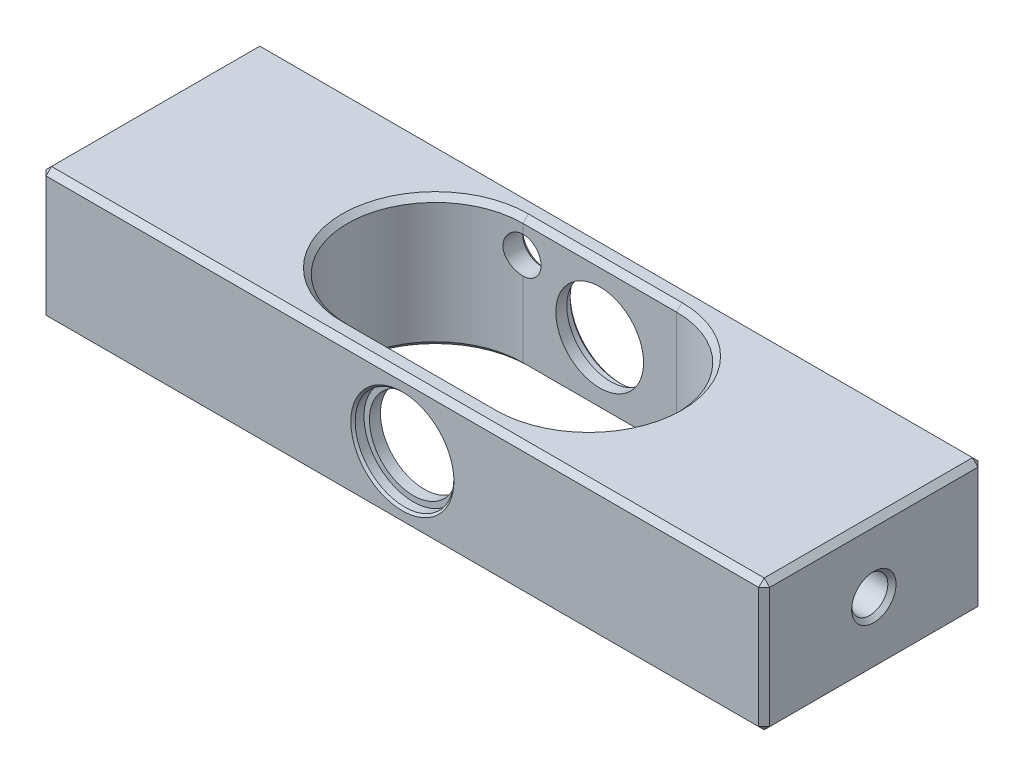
ISO-10303-21;
HEADER;
FILE_DESCRIPTION(('STEP AP214'),'2;1');
FILE_NAME('part.step','',(''),(''),'','','');
FILE_SCHEMA(('AUTOMOTIVE_DESIGN { 1 0 10303 214 1 1 1 1 }'));
ENDSEC;
DATA;
#1=APPLICATION_CONTEXT('core data for automotive mechanical design processes');
#2=APPLICATION_PROTOCOL_DEFINITION('international standard','automotive_design',2000,#1);
#3=PRODUCT_CONTEXT('',#1,'mechanical');
#4=PRODUCT('Part','Part','',(#3));
#5=PRODUCT_RELATED_PRODUCT_CATEGORY('part','',(#4));
#6=PRODUCT_DEFINITION_FORMATION('','',#4);
#7=PRODUCT_DEFINITION_CONTEXT('part definition',#1,'design');
#8=PRODUCT_DEFINITION('design','',#6,#7);
#9=PRODUCT_DEFINITION_SHAPE('','',#8);
#10=(LENGTH_UNIT() NAMED_UNIT(*) SI_UNIT(.MILLI.,.METRE.));
#11=(NAMED_UNIT(*) PLANE_ANGLE_UNIT() SI_UNIT($,.RADIAN.));
#12=(NAMED_UNIT(*) SI_UNIT($,.STERADIAN.) SOLID_ANGLE_UNIT());
#13=UNCERTAINTY_MEASURE_WITH_UNIT(LENGTH_MEASURE(1.E-05),#10,'distance_accuracy_value','');
#14=(GEOMETRIC_REPRESENTATION_CONTEXT(3) GLOBAL_UNCERTAINTY_ASSIGNED_CONTEXT((#13)) GLOBAL_UNIT_ASSIGNED_CONTEXT((#10,
#11,#12)) REPRESENTATION_CONTEXT('',''));
#15=CARTESIAN_POINT('',(0.,0.,0.));
#16=DIRECTION('',(0.,0.,1.));
#17=DIRECTION('',(1.,0.,0.));
#18=AXIS2_PLACEMENT_3D('',#15,#16,#17);
#19=CARTESIAN_POINT('',(33.,6.,0.));
#20=DIRECTION('',(0.,0.,-1.));
#21=DIRECTION('',(-1.,0.,0.));
#22=AXIS2_PLACEMENT_3D('',#19,#20,#21);
#23=CYLINDRICAL_SURFACE('',#22,4.);
#24=CARTESIAN_POINT('',(33.,6.,-18.));
#25=DIRECTION('',(0.,0.,-1.));
#26=DIRECTION('',(-1.,0.,0.));
#27=AXIS2_PLACEMENT_3D('',#24,#25,#26);
#28=CIRCLE('',#27,4.);
#29=CARTESIAN_POINT('',(29.,6.,-18.));
#30=VERTEX_POINT('',#29);
#31=EDGE_CURVE('E388',#30,#30,#28,.T.);
#32=ORIENTED_EDGE('',*,*,#31,.F.);
#33=EDGE_LOOP('',(#32));
#34=FACE_BOUND('',#33,.T.);
#35=CARTESIAN_POINT('',(33.,6.,-19.));
#36=DIRECTION('',(0.,0.,-1.));
#37=DIRECTION('',(-1.,0.,0.));
#38=AXIS2_PLACEMENT_3D('',#35,#36,#37);
#39=CIRCLE('',#38,4.);
#40=CARTESIAN_POINT('',(29.,6.,-19.));
#41=VERTEX_POINT('',#40);
#42=EDGE_CURVE('E395',#41,#41,#39,.F.);
#43=ORIENTED_EDGE('',*,*,#42,.F.);
#44=EDGE_LOOP('',(#43));
#45=FACE_BOUND('',#44,.T.);
#46=ADVANCED_FACE('F38',(#34,#45),#23,.F.);
#47=CARTESIAN_POINT('',(33.,6.,-2.));
#48=DIRECTION('',(0.,0.,1.));
#49=DIRECTION('',(1.,0.,0.));
#50=AXIS2_PLACEMENT_3D('',#47,#48,#49);
#51=CIRCLE('',#50,4.);
#52=CARTESIAN_POINT('',(37.,6.,-2.));
#53=VERTEX_POINT('',#52);
#54=EDGE_CURVE('E381',#53,#53,#51,.T.);
#55=ORIENTED_EDGE('',*,*,#54,.F.);
#56=EDGE_LOOP('',(#55));
#57=FACE_BOUND('',#56,.T.);
#58=CARTESIAN_POINT('',(33.,6.,-1.));
#59=DIRECTION('',(0.,0.,1.));
#60=DIRECTION('',(1.,0.,0.));
#61=AXIS2_PLACEMENT_3D('',#58,#59,#60);
#62=CIRCLE('',#61,4.);
#63=CARTESIAN_POINT('',(37.,6.,-1.));
#64=VERTEX_POINT('',#63);
#65=EDGE_CURVE('E391',#64,#64,#62,.F.);
#66=ORIENTED_EDGE('',*,*,#65,.F.);
#67=EDGE_LOOP('',(#66));
#68=FACE_BOUND('',#67,.T.);
#69=ADVANCED_FACE('F419',(#57,#68),#23,.F.);
#70=CARTESIAN_POINT('',(0.,12.,0.));
#71=DIRECTION('',(1.,0.,0.));
#72=DIRECTION('',(0.,0.,-1.));
#73=AXIS2_PLACEMENT_3D('',#70,#71,#72);
#74=PLANE('',#73);
#75=CARTESIAN_POINT('',(0.,6.,-10.));
#76=DIRECTION('',(-1.,0.,0.));
#77=DIRECTION('',(0.,0.,1.));
#78=AXIS2_PLACEMENT_3D('',#75,#76,#77);
#79=CIRCLE('',#78,2.025);
#80=CARTESIAN_POINT('',(0.,6.,-7.975));
#81=VERTEX_POINT('',#80);
#82=EDGE_CURVE('E1107',#81,#81,#79,.T.);
#83=ORIENTED_EDGE('',*,*,#82,.F.);
#84=EDGE_LOOP('',(#83));
#85=FACE_BOUND('',#84,.T.);
#86=DIRECTION('',(0.,-1.,0.));
#87=VECTOR('',#86,1.);
#88=CARTESIAN_POINT('',(0.,12.,-19.5));
#89=LINE('',#88,#87);
#90=CARTESIAN_POINT('',(0.,11.5,-19.5));
#91=VERTEX_POINT('',#90);
#92=CARTESIAN_POINT('',(0.,0.499999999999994,-19.5));
#93=VERTEX_POINT('',#92);
#94=EDGE_CURVE('E255',#91,#93,#89,.T.);
#95=ORIENTED_EDGE('',*,*,#94,.T.);
#96=DIRECTION('',(0.,0.,1.));
#97=VECTOR('',#96,1.);
#98=CARTESIAN_POINT('',(0.,0.499999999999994,0.));
#99=LINE('',#98,#97);
#100=CARTESIAN_POINT('',(0.,0.499999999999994,-0.499999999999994));
#101=VERTEX_POINT('',#100);
#102=EDGE_CURVE('E257',#93,#101,#99,.T.);
#103=ORIENTED_EDGE('',*,*,#102,.T.);
#104=DIRECTION('',(0.,1.,0.));
#105=VECTOR('',#104,1.);
#106=CARTESIAN_POINT('',(0.,12.,-0.499999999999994));
#107=LINE('',#106,#105);
#108=CARTESIAN_POINT('',(0.,11.5,-0.499999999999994));
#109=VERTEX_POINT('',#108);
#110=EDGE_CURVE('E253',#101,#109,#107,.T.);
#111=ORIENTED_EDGE('',*,*,#110,.T.);
#112=DIRECTION('',(0.,0.,-1.));
#113=VECTOR('',#112,1.);
#114=CARTESIAN_POINT('',(0.,11.5,0.));
#115=LINE('',#114,#113);
#116=EDGE_CURVE('E251',#109,#91,#115,.T.);
#117=ORIENTED_EDGE('',*,*,#116,.T.);
#118=EDGE_LOOP('',(#95,#103,#111,#117));
#119=FACE_BOUND('',#118,.T.);
#120=ADVANCED_FACE('F425',(#85,#119),#74,.F.);
#121=CARTESIAN_POINT('',(0.,12.,0.));
#122=DIRECTION('',(0.,0.,-1.));
#123=DIRECTION('',(-1.,0.,0.));
#124=AXIS2_PLACEMENT_3D('',#121,#122,#123);
#125=PLANE('',#124);
#126=CARTESIAN_POINT('',(33.,6.,0.));
#127=DIRECTION('',(0.,0.,-1.));
#128=DIRECTION('',(-1.,0.,0.));
#129=AXIS2_PLACEMENT_3D('',#126,#127,#128);
#130=CIRCLE('',#129,4.7);
#131=CARTESIAN_POINT('',(28.3,6.,0.));
#132=VERTEX_POINT('',#131);
#133=EDGE_CURVE('E11',#132,#132,#130,.T.);
#134=ORIENTED_EDGE('',*,*,#133,.T.);
#135=EDGE_LOOP('',(#134));
#136=FACE_BOUND('',#135,.T.);
#137=DIRECTION('',(-1.,0.,0.));
#138=VECTOR('',#137,1.);
#139=CARTESIAN_POINT('',(0.,11.5,0.));
#140=LINE('',#139,#138);
#141=CARTESIAN_POINT('',(65.5,11.5,0.));
#142=VERTEX_POINT('',#141);
#143=CARTESIAN_POINT('',(0.5,11.5,0.));
#144=VERTEX_POINT('',#143);
#145=EDGE_CURVE('E278',#142,#144,#140,.T.);
#146=ORIENTED_EDGE('',*,*,#145,.T.);
#147=DIRECTION('',(0.,-1.,0.));
#148=VECTOR('',#147,1.);
#149=CARTESIAN_POINT('',(0.5,12.,0.));
#150=LINE('',#149,#148);
#151=CARTESIAN_POINT('',(0.5,0.5,0.));
#152=VERTEX_POINT('',#151);
#153=EDGE_CURVE('E284',#144,#152,#150,.T.);
#154=ORIENTED_EDGE('',*,*,#153,.T.);
#155=DIRECTION('',(1.,0.,0.));
#156=VECTOR('',#155,1.);
#157=CARTESIAN_POINT('',(66.,0.5,0.));
#158=LINE('',#157,#156);
#159=CARTESIAN_POINT('',(65.5,0.5,0.));
#160=VERTEX_POINT('',#159);
#161=EDGE_CURVE('E282',#152,#160,#158,.T.);
#162=ORIENTED_EDGE('',*,*,#161,.T.);
#163=DIRECTION('',(0.,1.,0.));
#164=VECTOR('',#163,1.);
#165=CARTESIAN_POINT('',(65.5,12.,0.));
#166=LINE('',#165,#164);
#167=EDGE_CURVE('E280',#160,#142,#166,.T.);
#168=ORIENTED_EDGE('',*,*,#167,.T.);
#169=EDGE_LOOP('',(#146,#154,#162,#168));
#170=FACE_BOUND('',#169,.T.);
#171=ADVANCED_FACE('F1016',(#136,#170),#125,.F.);
#172=CARTESIAN_POINT('',(66.,12.,0.));
#173=DIRECTION('',(-1.,0.,0.));
#174=DIRECTION('',(0.,0.,1.));
#175=AXIS2_PLACEMENT_3D('',#172,#173,#174);
#176=PLANE('',#175);
#177=CARTESIAN_POINT('',(66.,6.,-10.));
#178=DIRECTION('',(1.,0.,0.));
#179=DIRECTION('',(0.,0.,-1.));
#180=AXIS2_PLACEMENT_3D('',#177,#178,#179);
#181=CIRCLE('',#180,2.025);
#182=CARTESIAN_POINT('',(66.,6.,-12.025));
#183=VERTEX_POINT('',#182);
#184=EDGE_CURVE('E200',#183,#183,#181,.T.);
#185=ORIENTED_EDGE('',*,*,#184,.F.);
#186=EDGE_LOOP('',(#185));
#187=FACE_BOUND('',#186,.T.);
#188=DIRECTION('',(0.,0.,-1.));
#189=VECTOR('',#188,1.);
#190=CARTESIAN_POINT('',(66.,0.5,-20.));
#191=LINE('',#190,#189);
#192=CARTESIAN_POINT('',(66.,0.5,-0.5));
#193=VERTEX_POINT('',#192);
#194=CARTESIAN_POINT('',(66.,0.5,-19.5));
#195=VERTEX_POINT('',#194);
#196=EDGE_CURVE('E273',#193,#195,#191,.T.);
#197=ORIENTED_EDGE('',*,*,#196,.T.);
#198=DIRECTION('',(0.,1.,0.));
#199=VECTOR('',#198,1.);
#200=CARTESIAN_POINT('',(66.,12.,-19.5));
#201=LINE('',#200,#199);
#202=CARTESIAN_POINT('',(66.,11.5,-19.5));
#203=VERTEX_POINT('',#202);
#204=EDGE_CURVE('E275',#195,#203,#201,.T.);
#205=ORIENTED_EDGE('',*,*,#204,.T.);
#206=DIRECTION('',(0.,0.,1.));
#207=VECTOR('',#206,1.);
#208=CARTESIAN_POINT('',(66.,11.5,0.));
#209=LINE('',#208,#207);
#210=CARTESIAN_POINT('',(66.,11.5,-0.5));
#211=VERTEX_POINT('',#210);
#212=EDGE_CURVE('E269',#203,#211,#209,.T.);
#213=ORIENTED_EDGE('',*,*,#212,.T.);
#214=DIRECTION('',(0.,-1.,0.));
#215=VECTOR('',#214,1.);
#216=CARTESIAN_POINT('',(66.,12.,-0.5));
#217=LINE('',#216,#215);
#218=EDGE_CURVE('E271',#211,#193,#217,.T.);
#219=ORIENTED_EDGE('',*,*,#218,.T.);
#220=EDGE_LOOP('',(#197,#205,#213,#219));
#221=FACE_BOUND('',#220,.T.);
#222=ADVANCED_FACE('F1007',(#187,#221),#176,.F.);
#223=CARTESIAN_POINT('',(0.,12.,-20.));
#224=DIRECTION('',(0.,0.,1.));
#225=DIRECTION('',(1.,0.,0.));
#226=AXIS2_PLACEMENT_3D('',#223,#224,#225);
#227=PLANE('',#226);
#228=CARTESIAN_POINT('',(33.,6.,-20.));
#229=DIRECTION('',(0.,0.,1.));
#230=DIRECTION('',(1.,0.,0.));
#231=AXIS2_PLACEMENT_3D('',#228,#229,#230);
#232=CIRCLE('',#231,4.7);
#233=CARTESIAN_POINT('',(37.7,6.,-20.));
#234=VERTEX_POINT('',#233);
#235=EDGE_CURVE('E401',#234,#234,#232,.T.);
#236=ORIENTED_EDGE('',*,*,#235,.T.);
#237=EDGE_LOOP('',(#236));
#238=FACE_BOUND('',#237,.T.);
#239=CARTESIAN_POINT('',(26.,9.,-20.));
#240=DIRECTION('',(0.,0.,-1.));
#241=DIRECTION('',(-1.,0.,0.));
#242=AXIS2_PLACEMENT_3D('',#239,#240,#241);
#243=CIRCLE('',#242,2.025);
#244=CARTESIAN_POINT('',(23.975,9.,-20.));
#245=VERTEX_POINT('',#244);
#246=EDGE_CURVE('E1190',#245,#245,#243,.T.);
#247=ORIENTED_EDGE('',*,*,#246,.F.);
#248=EDGE_LOOP('',(#247));
#249=FACE_BOUND('',#248,.T.);
#250=DIRECTION('',(-1.,0.,0.));
#251=VECTOR('',#250,1.);
#252=CARTESIAN_POINT('',(0.,0.5,-20.));
#253=LINE('',#252,#251);
#254=CARTESIAN_POINT('',(65.5,0.5,-20.));
#255=VERTEX_POINT('',#254);
#256=CARTESIAN_POINT('',(0.5,0.5,-20.));
#257=VERTEX_POINT('',#256);
#258=EDGE_CURVE('E264',#255,#257,#253,.T.);
#259=ORIENTED_EDGE('',*,*,#258,.T.);
#260=DIRECTION('',(0.,1.,0.));
#261=VECTOR('',#260,1.);
#262=CARTESIAN_POINT('',(0.5,12.,-20.));
#263=LINE('',#262,#261);
#264=CARTESIAN_POINT('',(0.5,11.5,-20.));
#265=VERTEX_POINT('',#264);
#266=EDGE_CURVE('E266',#257,#265,#263,.T.);
#267=ORIENTED_EDGE('',*,*,#266,.T.);
#268=DIRECTION('',(1.,0.,0.));
#269=VECTOR('',#268,1.);
#270=CARTESIAN_POINT('',(0.,11.5,-20.));
#271=LINE('',#270,#269);
#272=CARTESIAN_POINT('',(65.5,11.5,-20.));
#273=VERTEX_POINT('',#272);
#274=EDGE_CURVE('E260',#265,#273,#271,.T.);
#275=ORIENTED_EDGE('',*,*,#274,.T.);
#276=DIRECTION('',(0.,-1.,0.));
#277=VECTOR('',#276,1.);
#278=CARTESIAN_POINT('',(65.5,12.,-20.));
#279=LINE('',#278,#277);
#280=EDGE_CURVE('E262',#273,#255,#279,.T.);
#281=ORIENTED_EDGE('',*,*,#280,.T.);
#282=EDGE_LOOP('',(#259,#267,#275,#281));
#283=FACE_BOUND('',#282,.T.);
#284=ADVANCED_FACE('F999',(#238,#249,#283),#227,.F.);
#285=CARTESIAN_POINT('',(0.,12.,-20.));
#286=DIRECTION('',(0.,-1.,0.));
#287=DIRECTION('',(0.,0.,-1.));
#288=AXIS2_PLACEMENT_3D('',#285,#286,#287);
#289=PLANE('',#288);
#290=DIRECTION('',(0.,0.,-1.));
#291=VECTOR('',#290,1.);
#292=CARTESIAN_POINT('',(65.5,12.,-20.));
#293=LINE('',#292,#291);
#294=CARTESIAN_POINT('',(65.5,12.,-0.5));
#295=VERTEX_POINT('',#294);
#296=CARTESIAN_POINT('',(65.5,12.,-19.5));
#297=VERTEX_POINT('',#296);
#298=EDGE_CURVE('E60',#295,#297,#293,.T.);
#299=ORIENTED_EDGE('',*,*,#298,.T.);
#300=DIRECTION('',(-1.,0.,0.));
#301=VECTOR('',#300,1.);
#302=CARTESIAN_POINT('',(0.,12.,-19.5));
#303=LINE('',#302,#301);
#304=CARTESIAN_POINT('',(0.5,12.,-19.5));
#305=VERTEX_POINT('',#304);
#306=EDGE_CURVE('E192',#297,#305,#303,.T.);
#307=ORIENTED_EDGE('',*,*,#306,.T.);
#308=DIRECTION('',(0.,0.,1.));
#309=VECTOR('',#308,1.);
#310=CARTESIAN_POINT('',(0.5,12.,-20.));
#311=LINE('',#310,#309);
#312=CARTESIAN_POINT('',(0.5,12.,-0.5));
#313=VERTEX_POINT('',#312);
#314=EDGE_CURVE('E296',#305,#313,#311,.T.);
#315=ORIENTED_EDGE('',*,*,#314,.T.);
#316=DIRECTION('',(1.,0.,0.));
#317=VECTOR('',#316,1.);
#318=CARTESIAN_POINT('',(0.,12.,-0.5));
#319=LINE('',#318,#317);
#320=EDGE_CURVE('E298',#313,#295,#319,.T.);
#321=ORIENTED_EDGE('',*,*,#320,.T.);
#322=EDGE_LOOP('',(#299,#307,#315,#321));
#323=FACE_BOUND('',#322,.T.);
#324=DIRECTION('',(-1.,0.,0.));
#325=VECTOR('',#324,1.);
#326=CARTESIAN_POINT('',(0.,12.,-1.5));
#327=LINE('',#326,#325);
#328=CARTESIAN_POINT('',(40.,12.,-1.50000000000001));
#329=VERTEX_POINT('',#328);
#330=CARTESIAN_POINT('',(26.,12.,-1.5));
#331=VERTEX_POINT('',#330);
#332=EDGE_CURVE('E291',#329,#331,#327,.T.);
#333=ORIENTED_EDGE('',*,*,#332,.T.);
#334=CARTESIAN_POINT('',(26.,12.,-10.));
#335=DIRECTION('',(0.,-1.,0.));
#336=DIRECTION('',(0.,0.,-1.));
#337=AXIS2_PLACEMENT_3D('',#334,#335,#336);
#338=CIRCLE('',#337,8.49999999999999);
#339=CARTESIAN_POINT('',(26.,12.,-18.5));
#340=VERTEX_POINT('',#339);
#341=EDGE_CURVE('E293',#331,#340,#338,.T.);
#342=ORIENTED_EDGE('',*,*,#341,.T.);
#343=DIRECTION('',(1.,0.,0.));
#344=VECTOR('',#343,1.);
#345=CARTESIAN_POINT('',(0.,12.,-18.5));
#346=LINE('',#345,#344);
#347=CARTESIAN_POINT('',(40.,12.,-18.5));
#348=VERTEX_POINT('',#347);
#349=EDGE_CURVE('E287',#340,#348,#346,.T.);
#350=ORIENTED_EDGE('',*,*,#349,.T.);
#351=CARTESIAN_POINT('',(40.,12.,-10.));
#352=DIRECTION('',(0.,-1.,0.));
#353=DIRECTION('',(0.,0.,-1.));
#354=AXIS2_PLACEMENT_3D('',#351,#352,#353);
#355=CIRCLE('',#354,8.49999999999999);
#356=EDGE_CURVE('E289',#348,#329,#355,.T.);
#357=ORIENTED_EDGE('',*,*,#356,.T.);
#358=EDGE_LOOP('',(#333,#342,#350,#357));
#359=FACE_BOUND('',#358,.T.);
#360=ADVANCED_FACE('F990',(#323,#359),#289,.F.);
#361=CARTESIAN_POINT('',(0.,0.,-20.));
#362=DIRECTION('',(0.,-1.,0.));
#363=DIRECTION('',(0.,0.,-1.));
#364=AXIS2_PLACEMENT_3D('',#361,#362,#363);
#365=PLANE('',#364);
#366=CARTESIAN_POINT('',(26.,0.,-10.));
#367=DIRECTION('',(0.,-1.,0.));
#368=DIRECTION('',(0.,0.,-1.));
#369=AXIS2_PLACEMENT_3D('',#366,#367,#368);
#370=CIRCLE('',#369,8.5);
#371=CARTESIAN_POINT('',(26.,0.,-18.5));
#372=VERTEX_POINT('',#371);
#373=CARTESIAN_POINT('',(26.,0.,-1.5));
#374=VERTEX_POINT('',#373);
#375=EDGE_CURVE('E230',#372,#374,#370,.F.);
#376=ORIENTED_EDGE('',*,*,#375,.T.);
#377=DIRECTION('',(1.,0.,0.));
#378=VECTOR('',#377,1.);
#379=CARTESIAN_POINT('',(40.,0.,-1.5));
#380=LINE('',#379,#378);
#381=CARTESIAN_POINT('',(40.,0.,-1.5));
#382=VERTEX_POINT('',#381);
#383=EDGE_CURVE('E232',#374,#382,#380,.T.);
#384=ORIENTED_EDGE('',*,*,#383,.T.);
#385=CARTESIAN_POINT('',(40.,0.,-10.));
#386=DIRECTION('',(0.,-1.,0.));
#387=DIRECTION('',(0.,0.,-1.));
#388=AXIS2_PLACEMENT_3D('',#385,#386,#387);
#389=CIRCLE('',#388,8.5);
#390=CARTESIAN_POINT('',(40.,0.,-18.5));
#391=VERTEX_POINT('',#390);
#392=EDGE_CURVE('E226',#382,#391,#389,.F.);
#393=ORIENTED_EDGE('',*,*,#392,.T.);
#394=DIRECTION('',(-1.,0.,0.));
#395=VECTOR('',#394,1.);
#396=CARTESIAN_POINT('',(26.,0.,-18.5));
#397=LINE('',#396,#395);
#398=EDGE_CURVE('E228',#391,#372,#397,.T.);
#399=ORIENTED_EDGE('',*,*,#398,.T.);
#400=EDGE_LOOP('',(#376,#384,#393,#399));
#401=FACE_BOUND('',#400,.T.);
#402=DIRECTION('',(-1.,0.,0.));
#403=VECTOR('',#402,1.);
#404=CARTESIAN_POINT('',(0.,0.,-0.499999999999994));
#405=LINE('',#404,#403);
#406=CARTESIAN_POINT('',(65.5,0.,-0.499999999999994));
#407=VERTEX_POINT('',#406);
#408=CARTESIAN_POINT('',(0.5,0.,-0.499999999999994));
#409=VERTEX_POINT('',#408);
#410=EDGE_CURVE('E216',#407,#409,#405,.T.);
#411=ORIENTED_EDGE('',*,*,#410,.T.);
#412=DIRECTION('',(0.,0.,-1.));
#413=VECTOR('',#412,1.);
#414=CARTESIAN_POINT('',(0.5,0.,-20.));
#415=LINE('',#414,#413);
#416=CARTESIAN_POINT('',(0.5,0.,-19.5));
#417=VERTEX_POINT('',#416);
#418=EDGE_CURVE('E223',#409,#417,#415,.T.);
#419=ORIENTED_EDGE('',*,*,#418,.T.);
#420=DIRECTION('',(1.,0.,0.));
#421=VECTOR('',#420,1.);
#422=CARTESIAN_POINT('',(66.,0.,-19.5));
#423=LINE('',#422,#421);
#424=CARTESIAN_POINT('',(65.5,0.,-19.5));
#425=VERTEX_POINT('',#424);
#426=EDGE_CURVE('E221',#417,#425,#423,.T.);
#427=ORIENTED_EDGE('',*,*,#426,.T.);
#428=DIRECTION('',(0.,0.,1.));
#429=VECTOR('',#428,1.);
#430=CARTESIAN_POINT('',(65.5,0.,0.));
#431=LINE('',#430,#429);
#432=EDGE_CURVE('E218',#425,#407,#431,.T.);
#433=ORIENTED_EDGE('',*,*,#432,.T.);
#434=EDGE_LOOP('',(#411,#419,#427,#433));
#435=FACE_BOUND('',#434,.T.);
#436=ADVANCED_FACE('F541',(#401,#435),#365,.T.);
#437=CARTESIAN_POINT('',(40.,0.,-10.));
#438=DIRECTION('',(0.,1.,0.));
#439=DIRECTION('',(0.,0.,1.));
#440=AXIS2_PLACEMENT_3D('',#437,#438,#439);
#441=CYLINDRICAL_SURFACE('',#440,8.);
#442=DIRECTION('',(0.,1.,0.));
#443=VECTOR('',#442,1.);
#444=CARTESIAN_POINT('',(40.,0.,-18.));
#445=LINE('',#444,#443);
#446=CARTESIAN_POINT('',(40.,0.499999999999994,-18.));
#447=VERTEX_POINT('',#446);
#448=CARTESIAN_POINT('',(40.,11.5,-18.));
#449=VERTEX_POINT('',#448);
#450=EDGE_CURVE('E208',#447,#449,#445,.T.);
#451=ORIENTED_EDGE('',*,*,#450,.F.);
#452=CARTESIAN_POINT('',(40.,0.499999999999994,-10.));
#453=DIRECTION('',(0.,-1.,0.));
#454=DIRECTION('',(0.,0.,-1.));
#455=AXIS2_PLACEMENT_3D('',#452,#453,#454);
#456=CIRCLE('',#455,8.);
#457=CARTESIAN_POINT('',(40.,0.499999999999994,-2.));
#458=VERTEX_POINT('',#457);
#459=EDGE_CURVE('E249',#447,#458,#456,.T.);
#460=ORIENTED_EDGE('',*,*,#459,.T.);
#461=DIRECTION('',(0.,1.,0.));
#462=VECTOR('',#461,1.);
#463=CARTESIAN_POINT('',(40.,0.,-2.));
#464=LINE('',#463,#462);
#465=CARTESIAN_POINT('',(40.,11.5,-2.));
#466=VERTEX_POINT('',#465);
#467=EDGE_CURVE('E219',#458,#466,#464,.T.);
#468=ORIENTED_EDGE('',*,*,#467,.T.);
#469=CARTESIAN_POINT('',(40.,11.5,-10.));
#470=DIRECTION('',(0.,-1.,0.));
#471=DIRECTION('',(0.,0.,-1.));
#472=AXIS2_PLACEMENT_3D('',#469,#470,#471);
#473=CIRCLE('',#472,8.);
#474=EDGE_CURVE('E247',#466,#449,#473,.F.);
#475=ORIENTED_EDGE('',*,*,#474,.T.);
#476=EDGE_LOOP('',(#451,#460,#468,#475));
#477=FACE_BOUND('',#476,.T.);
#478=ADVANCED_FACE('F435',(#477),#441,.F.);
#479=CARTESIAN_POINT('',(26.,0.,-2.));
#480=DIRECTION('',(0.,0.,1.));
#481=DIRECTION('',(1.,0.,0.));
#482=AXIS2_PLACEMENT_3D('',#479,#480,#481);
#483=PLANE('',#482);
#484=ORIENTED_EDGE('',*,*,#54,.T.);
#485=EDGE_LOOP('',(#484));
#486=FACE_BOUND('',#485,.T.);
#487=ORIENTED_EDGE('',*,*,#467,.F.);
#488=DIRECTION('',(-1.,0.,0.));
#489=VECTOR('',#488,1.);
#490=CARTESIAN_POINT('',(26.,0.499999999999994,-2.));
#491=LINE('',#490,#489);
#492=CARTESIAN_POINT('',(26.,0.499999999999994,-2.));
#493=VERTEX_POINT('',#492);
#494=EDGE_CURVE('E237',#458,#493,#491,.T.);
#495=ORIENTED_EDGE('',*,*,#494,.T.);
#496=DIRECTION('',(0.,1.,0.));
#497=VECTOR('',#496,1.);
#498=CARTESIAN_POINT('',(26.,0.,-2.));
#499=LINE('',#498,#497);
#500=CARTESIAN_POINT('',(26.,11.5,-2.));
#501=VERTEX_POINT('',#500);
#502=EDGE_CURVE('E210',#493,#501,#499,.T.);
#503=ORIENTED_EDGE('',*,*,#502,.T.);
#504=DIRECTION('',(1.,0.,0.));
#505=VECTOR('',#504,1.);
#506=CARTESIAN_POINT('',(26.,11.5,-2.));
#507=LINE('',#506,#505);
#508=EDGE_CURVE('E235',#501,#466,#507,.T.);
#509=ORIENTED_EDGE('',*,*,#508,.T.);
#510=EDGE_LOOP('',(#487,#495,#503,#509));
#511=FACE_BOUND('',#510,.T.);
#512=ADVANCED_FACE('F432',(#486,#511),#483,.F.);
#513=CARTESIAN_POINT('',(26.,0.,-10.));
#514=DIRECTION('',(0.,1.,0.));
#515=DIRECTION('',(0.,0.,1.));
#516=AXIS2_PLACEMENT_3D('',#513,#514,#515);
#517=CYLINDRICAL_SURFACE('',#516,8.);
#518=DIRECTION('',(0.,1.,0.));
#519=VECTOR('',#518,1.);
#520=CARTESIAN_POINT('',(26.,0.,-18.));
#521=LINE('',#520,#519);
#522=CARTESIAN_POINT('',(26.,0.499999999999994,-18.));
#523=VERTEX_POINT('',#522);
#524=CARTESIAN_POINT('',(26.,7.35000000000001,-18.));
#525=VERTEX_POINT('',#524);
#526=EDGE_CURVE('E199',#523,#525,#521,.T.);
#527=ORIENTED_EDGE('',*,*,#526,.T.);
#528=CARTESIAN_POINT('',(26.,7.35000000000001,-18.));
#529=CARTESIAN_POINT('',(25.9540957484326,7.34999974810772,-18.0000021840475));
#530=CARTESIAN_POINT('',(25.9082139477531,7.35191685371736,-17.9996044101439));
#531=CARTESIAN_POINT('',(25.8167878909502,7.3595612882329,-17.9980321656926));
#532=CARTESIAN_POINT('',(25.7712435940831,7.36528814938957,-17.9968577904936));
#533=CARTESIAN_POINT('',(25.6357581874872,7.38811040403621,-17.9922119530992));
#534=CARTESIAN_POINT('',(25.5467392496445,7.41084774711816,-17.9876175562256));
#535=CARTESIAN_POINT('',(25.3738831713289,7.47066799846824,-17.975932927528));
#536=CARTESIAN_POINT('',(25.2900466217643,7.50775253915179,-17.9688424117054));
#537=CARTESIAN_POINT('',(25.1297630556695,7.59518022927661,-17.952935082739));
#538=CARTESIAN_POINT('',(25.0533168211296,7.64552477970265,-17.9441180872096));
#539=CARTESIAN_POINT('',(24.9089234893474,7.75879865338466,-17.9255869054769));
#540=CARTESIAN_POINT('',(24.8410971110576,7.8218801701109,-17.915862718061));
#541=CARTESIAN_POINT('',(24.7169026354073,7.95851744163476,-17.8966840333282));
#542=CARTESIAN_POINT('',(24.6605364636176,8.03207495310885,-17.8872295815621));
#543=CARTESIAN_POINT('',(24.5603474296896,8.1884547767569,-17.86956305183));
#544=CARTESIAN_POINT('',(24.5166516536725,8.27136010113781,-17.8613639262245));
#545=CARTESIAN_POINT('',(24.4438600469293,8.44352866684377,-17.847280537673));
#546=CARTESIAN_POINT('',(24.4147618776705,8.53279088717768,-17.8413959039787));
#547=CARTESIAN_POINT('',(24.3723853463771,8.71383089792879,-17.8327093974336));
#548=CARTESIAN_POINT('',(24.3588928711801,8.80555652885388,-17.8298658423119));
#549=CARTESIAN_POINT('',(24.3474453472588,8.99001238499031,-17.8274580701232));
#550=CARTESIAN_POINT('',(24.3494889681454,9.08274252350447,-17.8278935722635));
#551=CARTESIAN_POINT('',(24.368883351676,9.26499576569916,-17.8319569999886));
#552=CARTESIAN_POINT('',(24.3859871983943,9.35454646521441,-17.8355334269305));
#553=CARTESIAN_POINT('',(24.4346261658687,9.52947877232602,-17.8453944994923));
#554=CARTESIAN_POINT('',(24.4661619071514,9.61486020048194,-17.8516792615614));
#555=CARTESIAN_POINT('',(24.5430028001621,9.77973819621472,-17.8663010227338));
#556=CARTESIAN_POINT('',(24.5884050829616,9.85918816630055,-17.8746524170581));
#557=CARTESIAN_POINT('',(24.6916205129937,10.0094314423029,-17.892456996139));
#558=CARTESIAN_POINT('',(24.7494347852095,10.0802239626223,-17.901910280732));
#559=CARTESIAN_POINT('',(24.8771417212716,10.212561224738,-17.9210749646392));
#560=CARTESIAN_POINT('',(24.9472434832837,10.2739041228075,-17.9307878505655));
#561=CARTESIAN_POINT('',(25.0968687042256,10.3840091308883,-17.9492153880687));
#562=CARTESIAN_POINT('',(25.1763946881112,10.4327678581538,-17.957929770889));
#563=CARTESIAN_POINT('',(25.3428536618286,10.5163633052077,-17.9734033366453));
#564=CARTESIAN_POINT('',(25.4298031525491,10.5511679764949,-17.9801580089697));
#565=CARTESIAN_POINT('',(25.6084301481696,10.6055716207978,-17.9909097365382));
#566=CARTESIAN_POINT('',(25.7001004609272,10.6251930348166,-17.9949108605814));
#567=CARTESIAN_POINT('',(25.8270919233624,10.6412836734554,-17.9982061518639));
#568=CARTESIAN_POINT('',(25.861619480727,10.6445533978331,-17.9988781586));
#569=CARTESIAN_POINT('',(25.9307594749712,10.6489088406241,-17.9997747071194));
#570=CARTESIAN_POINT('',(25.9653716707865,10.6499982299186,-18.0000000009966));
#571=CARTESIAN_POINT('',(26.,10.65,-18.));
#572=B_SPLINE_CURVE_WITH_KNOTS('',3,(#528,#529,#530,#531,#532,#533,#534,#535,#536,#537,#538,
#539,#540,#541,#542,#543,#544,#545,#546,#547,#548,#549,#550,#551,#552,#553,#554,#555,#556,#557,
#558,#559,#560,#561,#562,#563,#564,#565,#566,#567,#568,#569,#570,#571),.UNSPECIFIED.,.F.,.F.,(4,
2,2,2,2,2,2,2,2,2,2,2,2,2,2,2,2,2,2,2,2,4),(0.,0.137626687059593,0.275236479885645,
0.549788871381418,0.824372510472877,1.09898517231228,1.37709724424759,1.65525600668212,
1.93611520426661,2.2169293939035,2.49384326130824,2.7707334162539,3.04316669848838,
3.31561169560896,3.59001064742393,3.86443448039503,4.14408569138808,4.42381199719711,
4.70417712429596,4.98412707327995,5.08813730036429,5.19197226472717),.UNSPECIFIED.);
#573=CARTESIAN_POINT('',(26.,10.65,-18.));
#574=VERTEX_POINT('',#573);
#575=EDGE_CURVE('E52',#525,#574,#572,.T.);
#576=ORIENTED_EDGE('',*,*,#575,.T.);
#577=CARTESIAN_POINT('',(26.,11.5,-18.));
#578=VERTEX_POINT('',#577);
#579=EDGE_CURVE('E197',#574,#578,#521,.T.);
#580=ORIENTED_EDGE('',*,*,#579,.T.);
#581=CARTESIAN_POINT('',(26.,11.5,-10.));
#582=DIRECTION('',(0.,-1.,0.));
#583=DIRECTION('',(0.,0.,-1.));
#584=AXIS2_PLACEMENT_3D('',#581,#582,#583);
#585=CIRCLE('',#584,8.);
#586=EDGE_CURVE('E240',#578,#501,#585,.F.);
#587=ORIENTED_EDGE('',*,*,#586,.T.);
#588=ORIENTED_EDGE('',*,*,#502,.F.);
#589=CARTESIAN_POINT('',(26.,0.499999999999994,-10.));
#590=DIRECTION('',(0.,-1.,0.));
#591=DIRECTION('',(0.,0.,-1.));
#592=AXIS2_PLACEMENT_3D('',#589,#590,#591);
#593=CIRCLE('',#592,8.);
#594=EDGE_CURVE('E242',#493,#523,#593,.T.);
#595=ORIENTED_EDGE('',*,*,#594,.T.);
#596=EDGE_LOOP('',(#527,#576,#580,#587,#588,#595));
#597=FACE_BOUND('',#596,.T.);
#598=ADVANCED_FACE('F195',(#597),#517,.F.);
#599=CARTESIAN_POINT('',(40.,0.,-18.));
#600=DIRECTION('',(0.,0.,-1.));
#601=DIRECTION('',(-1.,0.,0.));
#602=AXIS2_PLACEMENT_3D('',#599,#600,#601);
#603=PLANE('',#602);
#604=ORIENTED_EDGE('',*,*,#31,.T.);
#605=EDGE_LOOP('',(#604));
#606=FACE_BOUND('',#605,.T.);
#607=ORIENTED_EDGE('',*,*,#579,.F.);
#608=CARTESIAN_POINT('',(26.,9.,-18.));
#609=DIRECTION('',(0.,0.,-1.));
#610=DIRECTION('',(-1.,0.,0.));
#611=AXIS2_PLACEMENT_3D('',#608,#609,#610);
#612=CIRCLE('',#611,1.65);
#613=EDGE_CURVE('E185',#574,#525,#612,.T.);
#614=ORIENTED_EDGE('',*,*,#613,.T.);
#615=ORIENTED_EDGE('',*,*,#526,.F.);
#616=DIRECTION('',(1.,0.,0.));
#617=VECTOR('',#616,1.);
#618=CARTESIAN_POINT('',(40.,0.499999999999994,-18.));
#619=LINE('',#618,#617);
#620=EDGE_CURVE('E245',#523,#447,#619,.T.);
#621=ORIENTED_EDGE('',*,*,#620,.T.);
#622=ORIENTED_EDGE('',*,*,#450,.T.);
#623=DIRECTION('',(-1.,0.,0.));
#624=VECTOR('',#623,1.);
#625=CARTESIAN_POINT('',(40.,11.5,-18.));
#626=LINE('',#625,#624);
#627=EDGE_CURVE('E206',#449,#578,#626,.T.);
#628=ORIENTED_EDGE('',*,*,#627,.T.);
#629=EDGE_LOOP('',(#607,#614,#615,#621,#622,#628));
#630=FACE_BOUND('',#629,.T.);
#631=ADVANCED_FACE('F203',(#606,#630),#603,.F.);
#632=CARTESIAN_POINT('',(0.,0.,-18.5));
#633=DIRECTION('',(0.,-0.707106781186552,0.707106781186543));
#634=DIRECTION('',(0.,-0.707106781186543,-0.707106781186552));
#635=AXIS2_PLACEMENT_3D('',#632,#633,#634);
#636=PLANE('',#635);
#637=DIRECTION('',(0.,-0.707106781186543,-0.707106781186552));
#638=VECTOR('',#637,1.);
#639=CARTESIAN_POINT('',(40.,0.499999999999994,-18.));
#640=LINE('',#639,#638);
#641=EDGE_CURVE('E307',#447,#391,#640,.T.);
#642=ORIENTED_EDGE('',*,*,#641,.F.);
#643=ORIENTED_EDGE('',*,*,#620,.F.);
#644=DIRECTION('',(0.,0.707106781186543,0.707106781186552));
#645=VECTOR('',#644,1.);
#646=CARTESIAN_POINT('',(26.,0.,-18.5));
#647=LINE('',#646,#645);
#648=EDGE_CURVE('E211',#372,#523,#647,.T.);
#649=ORIENTED_EDGE('',*,*,#648,.F.);
#650=ORIENTED_EDGE('',*,*,#398,.F.);
#651=EDGE_LOOP('',(#642,#643,#649,#650));
#652=FACE_BOUND('',#651,.T.);
#653=ADVANCED_FACE('F532',(#652),#636,.T.);
#654=CARTESIAN_POINT('',(26.,0.,-10.));
#655=DIRECTION('',(0.,-1.,0.));
#656=DIRECTION('',(0.,0.,-1.));
#657=AXIS2_PLACEMENT_3D('',#654,#655,#656);
#658=CONICAL_SURFACE('',#657,8.5,0.785398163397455);
#659=ORIENTED_EDGE('',*,*,#648,.T.);
#660=ORIENTED_EDGE('',*,*,#594,.F.);
#661=DIRECTION('',(0.,0.707106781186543,-0.707106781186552));
#662=VECTOR('',#661,1.);
#663=CARTESIAN_POINT('',(26.,0.,-1.5));
#664=LINE('',#663,#662);
#665=EDGE_CURVE('E304',#374,#493,#664,.T.);
#666=ORIENTED_EDGE('',*,*,#665,.F.);
#667=ORIENTED_EDGE('',*,*,#375,.F.);
#668=EDGE_LOOP('',(#659,#660,#666,#667));
#669=FACE_BOUND('',#668,.T.);
#670=ADVANCED_FACE('F537',(#669),#658,.F.);
#671=CARTESIAN_POINT('',(40.,0.,-10.));
#672=DIRECTION('',(0.,-1.,0.));
#673=DIRECTION('',(0.,0.,-1.));
#674=AXIS2_PLACEMENT_3D('',#671,#672,#673);
#675=CONICAL_SURFACE('',#674,8.5,0.785398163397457);
#676=ORIENTED_EDGE('',*,*,#641,.T.);
#677=ORIENTED_EDGE('',*,*,#392,.F.);
#678=DIRECTION('',(0.,-0.707106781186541,0.707106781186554));
#679=VECTOR('',#678,1.);
#680=CARTESIAN_POINT('',(40.,0.499999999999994,-2.));
#681=LINE('',#680,#679);
#682=EDGE_CURVE('E302',#458,#382,#681,.T.);
#683=ORIENTED_EDGE('',*,*,#682,.F.);
#684=ORIENTED_EDGE('',*,*,#459,.F.);
#685=EDGE_LOOP('',(#676,#677,#683,#684));
#686=FACE_BOUND('',#685,.T.);
#687=ADVANCED_FACE('F545',(#686),#675,.F.);
#688=CARTESIAN_POINT('',(0.,0.,-1.5));
#689=DIRECTION('',(0.,-0.707106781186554,-0.707106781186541));
#690=DIRECTION('',(0.,0.707106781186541,-0.707106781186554));
#691=AXIS2_PLACEMENT_3D('',#688,#689,#690);
#692=PLANE('',#691);
#693=ORIENTED_EDGE('',*,*,#665,.T.);
#694=ORIENTED_EDGE('',*,*,#494,.F.);
#695=ORIENTED_EDGE('',*,*,#682,.T.);
#696=ORIENTED_EDGE('',*,*,#383,.F.);
#697=EDGE_LOOP('',(#693,#694,#695,#696));
#698=FACE_BOUND('',#697,.T.);
#699=ADVANCED_FACE('F548',(#698),#692,.T.);
#700=CARTESIAN_POINT('',(65.5,12.,-20.));
#701=DIRECTION('',(-0.707106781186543,-0.707106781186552,0.));
#702=DIRECTION('',(0.707106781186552,-0.707106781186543,0.));
#703=AXIS2_PLACEMENT_3D('',#700,#701,#702);
#704=PLANE('',#703);
#705=DIRECTION('',(-0.707106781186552,0.707106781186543,0.));
#706=VECTOR('',#705,1.);
#707=CARTESIAN_POINT('',(66.,11.5,-19.5));
#708=LINE('',#707,#706);
#709=EDGE_CURVE('E305',#297,#203,#708,.F.);
#710=ORIENTED_EDGE('',*,*,#709,.F.);
#711=ORIENTED_EDGE('',*,*,#298,.F.);
#712=DIRECTION('',(0.707106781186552,-0.707106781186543,0.));
#713=VECTOR('',#712,1.);
#714=CARTESIAN_POINT('',(65.75,11.75,-0.500000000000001));
#715=LINE('',#714,#713);
#716=EDGE_CURVE('E373',#211,#295,#715,.F.);
#717=ORIENTED_EDGE('',*,*,#716,.F.);
#718=ORIENTED_EDGE('',*,*,#212,.F.);
#719=EDGE_LOOP('',(#710,#711,#717,#718));
#720=FACE_BOUND('',#719,.T.);
#721=ADVANCED_FACE('F550',(#720),#704,.F.);
#722=CARTESIAN_POINT('',(66.,11.5,-19.5));
#723=DIRECTION('',(0.577350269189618,0.577350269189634,-0.577350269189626));
#724=DIRECTION('',(0.,0.707106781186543,0.707106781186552));
#725=AXIS2_PLACEMENT_3D('',#722,#723,#724);
#726=PLANE('',#725);
#727=DIRECTION('',(0.,-0.707106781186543,-0.707106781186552));
#728=VECTOR('',#727,1.);
#729=CARTESIAN_POINT('',(65.5,11.75,-19.75));
#730=LINE('',#729,#728);
#731=EDGE_CURVE('E368',#297,#273,#730,.T.);
#732=ORIENTED_EDGE('',*,*,#731,.F.);
#733=ORIENTED_EDGE('',*,*,#709,.T.);
#734=DIRECTION('',(0.707106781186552,0.,0.707106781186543));
#735=VECTOR('',#734,1.);
#736=CARTESIAN_POINT('',(66.,11.5,-19.5));
#737=LINE('',#736,#735);
#738=EDGE_CURVE('E371',#273,#203,#737,.T.);
#739=ORIENTED_EDGE('',*,*,#738,.F.);
#740=EDGE_LOOP('',(#732,#733,#739));
#741=FACE_BOUND('',#740,.T.);
#742=ADVANCED_FACE('F556',(#741),#726,.T.);
#743=CARTESIAN_POINT('',(65.5,11.5,0.));
#744=DIRECTION('',(0.577350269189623,0.577350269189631,0.577350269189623));
#745=DIRECTION('',(0.,-0.707106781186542,0.707106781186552));
#746=AXIS2_PLACEMENT_3D('',#743,#744,#745);
#747=PLANE('',#746);
#748=DIRECTION('',(-0.707106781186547,0.,0.707106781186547));
#749=VECTOR('',#748,1.);
#750=CARTESIAN_POINT('',(65.5,11.5,0.));
#751=LINE('',#750,#749);
#752=EDGE_CURVE('E362',#211,#142,#751,.T.);
#753=ORIENTED_EDGE('',*,*,#752,.F.);
#754=ORIENTED_EDGE('',*,*,#716,.T.);
#755=DIRECTION('',(0.,0.707106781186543,-0.707106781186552));
#756=VECTOR('',#755,1.);
#757=CARTESIAN_POINT('',(65.5,11.5,0.));
#758=LINE('',#757,#756);
#759=EDGE_CURVE('E365',#142,#295,#758,.T.);
#760=ORIENTED_EDGE('',*,*,#759,.F.);
#761=EDGE_LOOP('',(#753,#754,#760));
#762=FACE_BOUND('',#761,.T.);
#763=ADVANCED_FACE('F634',(#762),#747,.T.);
#764=CARTESIAN_POINT('',(65.5,12.,-20.));
#765=DIRECTION('',(-0.707106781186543,0.,0.707106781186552));
#766=DIRECTION('',(0.707106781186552,0.,0.707106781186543));
#767=AXIS2_PLACEMENT_3D('',#764,#765,#766);
#768=PLANE('',#767);
#769=ORIENTED_EDGE('',*,*,#738,.T.);
#770=ORIENTED_EDGE('',*,*,#204,.F.);
#771=DIRECTION('',(-0.707106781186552,0.,-0.707106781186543));
#772=VECTOR('',#771,1.);
#773=CARTESIAN_POINT('',(65.75,0.500000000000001,-19.75));
#774=LINE('',#773,#772);
#775=EDGE_CURVE('E356',#255,#195,#774,.F.);
#776=ORIENTED_EDGE('',*,*,#775,.F.);
#777=ORIENTED_EDGE('',*,*,#280,.F.);
#778=EDGE_LOOP('',(#769,#770,#776,#777));
#779=FACE_BOUND('',#778,.T.);
#780=ADVANCED_FACE('F630',(#779),#768,.F.);
#781=CARTESIAN_POINT('',(0.,12.,-19.5));
#782=DIRECTION('',(0.,-0.707106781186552,0.707106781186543));
#783=DIRECTION('',(0.,-0.707106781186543,-0.707106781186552));
#784=AXIS2_PLACEMENT_3D('',#781,#782,#783);
#785=PLANE('',#784);
#786=ORIENTED_EDGE('',*,*,#731,.T.);
#787=ORIENTED_EDGE('',*,*,#274,.F.);
#788=DIRECTION('',(0.,0.707106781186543,0.707106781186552));
#789=VECTOR('',#788,1.);
#790=CARTESIAN_POINT('',(0.5,11.5,-20.));
#791=LINE('',#790,#789);
#792=EDGE_CURVE('E353',#305,#265,#791,.F.);
#793=ORIENTED_EDGE('',*,*,#792,.F.);
#794=ORIENTED_EDGE('',*,*,#306,.F.);
#795=EDGE_LOOP('',(#786,#787,#793,#794));
#796=FACE_BOUND('',#795,.T.);
#797=ADVANCED_FACE('F626',(#796),#785,.F.);
#798=CARTESIAN_POINT('',(0.5,12.,-20.));
#799=DIRECTION('',(0.707106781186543,-0.707106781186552,0.));
#800=DIRECTION('',(0.707106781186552,0.707106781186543,0.));
#801=AXIS2_PLACEMENT_3D('',#798,#799,#800);
#802=PLANE('',#801);
#803=DIRECTION('',(0.707106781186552,0.707106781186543,0.));
#804=VECTOR('',#803,1.);
#805=CARTESIAN_POINT('',(0.,11.5,-0.499999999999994));
#806=LINE('',#805,#804);
#807=EDGE_CURVE('E348',#313,#109,#806,.F.);
#808=ORIENTED_EDGE('',*,*,#807,.F.);
#809=ORIENTED_EDGE('',*,*,#314,.F.);
#810=DIRECTION('',(-0.707106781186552,-0.707106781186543,0.));
#811=VECTOR('',#810,1.);
#812=CARTESIAN_POINT('',(0.25,11.75,-19.5));
#813=LINE('',#812,#811);
#814=EDGE_CURVE('E351',#91,#305,#813,.F.);
#815=ORIENTED_EDGE('',*,*,#814,.F.);
#816=ORIENTED_EDGE('',*,*,#116,.F.);
#817=EDGE_LOOP('',(#808,#809,#815,#816));
#818=FACE_BOUND('',#817,.T.);
#819=ADVANCED_FACE('F622',(#818),#802,.F.);
#820=CARTESIAN_POINT('',(0.,12.,-0.5));
#821=DIRECTION('',(0.,-0.707106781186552,-0.707106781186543));
#822=DIRECTION('',(0.,0.707106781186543,-0.707106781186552));
#823=AXIS2_PLACEMENT_3D('',#820,#821,#822);
#824=PLANE('',#823);
#825=ORIENTED_EDGE('',*,*,#759,.T.);
#826=ORIENTED_EDGE('',*,*,#320,.F.);
#827=DIRECTION('',(0.,-0.707106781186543,0.707106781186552));
#828=VECTOR('',#827,1.);
#829=CARTESIAN_POINT('',(0.5,11.75,-0.25));
#830=LINE('',#829,#828);
#831=EDGE_CURVE('E345',#144,#313,#830,.F.);
#832=ORIENTED_EDGE('',*,*,#831,.F.);
#833=ORIENTED_EDGE('',*,*,#145,.F.);
#834=EDGE_LOOP('',(#825,#826,#832,#833));
#835=FACE_BOUND('',#834,.T.);
#836=ADVANCED_FACE('F618',(#835),#824,.F.);
#837=CARTESIAN_POINT('',(66.,12.,-0.5));
#838=DIRECTION('',(-0.707106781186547,0.,-0.707106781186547));
#839=DIRECTION('',(-0.707106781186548,0.,0.707106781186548));
#840=AXIS2_PLACEMENT_3D('',#837,#838,#839);
#841=PLANE('',#840);
#842=ORIENTED_EDGE('',*,*,#752,.T.);
#843=ORIENTED_EDGE('',*,*,#167,.F.);
#844=DIRECTION('',(0.707106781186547,0.,-0.707106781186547));
#845=VECTOR('',#844,1.);
#846=CARTESIAN_POINT('',(65.75,0.5,-0.249999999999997));
#847=LINE('',#846,#845);
#848=EDGE_CURVE('E342',#193,#160,#847,.F.);
#849=ORIENTED_EDGE('',*,*,#848,.F.);
#850=ORIENTED_EDGE('',*,*,#218,.F.);
#851=EDGE_LOOP('',(#842,#843,#849,#850));
#852=FACE_BOUND('',#851,.T.);
#853=ADVANCED_FACE('F614',(#852),#841,.F.);
#854=CARTESIAN_POINT('',(66.,0.5,0.));
#855=DIRECTION('',(0.707106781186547,-0.707106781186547,0.));
#856=DIRECTION('',(0.707106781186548,0.707106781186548,0.));
#857=AXIS2_PLACEMENT_3D('',#854,#855,#856);
#858=PLANE('',#857);
#859=DIRECTION('',(-0.707106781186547,-0.707106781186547,0.));
#860=VECTOR('',#859,1.);
#861=CARTESIAN_POINT('',(65.5,0.,-19.5));
#862=LINE('',#861,#860);
#863=EDGE_CURVE('E359',#195,#425,#862,.T.);
#864=ORIENTED_EDGE('',*,*,#863,.F.);
#865=ORIENTED_EDGE('',*,*,#196,.F.);
#866=DIRECTION('',(0.707106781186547,0.707106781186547,0.));
#867=VECTOR('',#866,1.);
#868=CARTESIAN_POINT('',(65.5,0.,-0.499999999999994));
#869=LINE('',#868,#867);
#870=EDGE_CURVE('E339',#407,#193,#869,.T.);
#871=ORIENTED_EDGE('',*,*,#870,.F.);
#872=ORIENTED_EDGE('',*,*,#432,.F.);
#873=EDGE_LOOP('',(#864,#865,#871,#872));
#874=FACE_BOUND('',#873,.T.);
#875=ADVANCED_FACE('F610',(#874),#858,.T.);
#876=CARTESIAN_POINT('',(65.5,0.,-19.5));
#877=DIRECTION('',(0.577350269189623,-0.577350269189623,-0.577350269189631));
#878=DIRECTION('',(-0.707106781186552,0.,-0.707106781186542));
#879=AXIS2_PLACEMENT_3D('',#876,#877,#878);
#880=PLANE('',#879);
#881=ORIENTED_EDGE('',*,*,#775,.T.);
#882=ORIENTED_EDGE('',*,*,#863,.T.);
#883=DIRECTION('',(0.,0.707106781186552,-0.707106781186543));
#884=VECTOR('',#883,1.);
#885=CARTESIAN_POINT('',(65.5,0.,-19.5));
#886=LINE('',#885,#884);
#887=EDGE_CURVE('E336',#255,#425,#886,.F.);
#888=ORIENTED_EDGE('',*,*,#887,.F.);
#889=EDGE_LOOP('',(#881,#882,#888));
#890=FACE_BOUND('',#889,.T.);
#891=ADVANCED_FACE('F606',(#890),#880,.T.);
#892=CARTESIAN_POINT('',(0.5,11.5,-20.));
#893=DIRECTION('',(-0.577350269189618,0.577350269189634,-0.577350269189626));
#894=DIRECTION('',(0.,0.707106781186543,0.707106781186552));
#895=AXIS2_PLACEMENT_3D('',#892,#893,#894);
#896=PLANE('',#895);
#897=ORIENTED_EDGE('',*,*,#814,.T.);
#898=ORIENTED_EDGE('',*,*,#792,.T.);
#899=DIRECTION('',(0.707106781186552,0.,-0.707106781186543));
#900=VECTOR('',#899,1.);
#901=CARTESIAN_POINT('',(0.5,11.5,-20.));
#902=LINE('',#901,#900);
#903=EDGE_CURVE('E334',#91,#265,#902,.T.);
#904=ORIENTED_EDGE('',*,*,#903,.F.);
#905=EDGE_LOOP('',(#897,#898,#904));
#906=FACE_BOUND('',#905,.T.);
#907=ADVANCED_FACE('F602',(#906),#896,.T.);
#908=CARTESIAN_POINT('',(0.,11.5,-0.499999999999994));
#909=DIRECTION('',(-0.577350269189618,0.577350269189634,0.577350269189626));
#910=DIRECTION('',(0.,-0.707106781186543,0.707106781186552));
#911=AXIS2_PLACEMENT_3D('',#908,#909,#910);
#912=PLANE('',#911);
#913=ORIENTED_EDGE('',*,*,#831,.T.);
#914=ORIENTED_EDGE('',*,*,#807,.T.);
#915=DIRECTION('',(-0.707106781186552,0.,-0.707106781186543));
#916=VECTOR('',#915,1.);
#917=CARTESIAN_POINT('',(0.,11.5,-0.499999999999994));
#918=LINE('',#917,#916);
#919=EDGE_CURVE('E331',#144,#109,#918,.T.);
#920=ORIENTED_EDGE('',*,*,#919,.F.);
#921=EDGE_LOOP('',(#913,#914,#920));
#922=FACE_BOUND('',#921,.T.);
#923=ADVANCED_FACE('F598',(#922),#912,.T.);
#924=CARTESIAN_POINT('',(65.5,0.,-0.499999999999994));
#925=DIRECTION('',(0.577350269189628,-0.57735026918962,0.577350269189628));
#926=DIRECTION('',(0.707106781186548,0.,-0.707106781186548));
#927=AXIS2_PLACEMENT_3D('',#924,#925,#926);
#928=PLANE('',#927);
#929=ORIENTED_EDGE('',*,*,#870,.T.);
#930=ORIENTED_EDGE('',*,*,#848,.T.);
#931=DIRECTION('',(0.,-0.707106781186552,-0.707106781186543));
#932=VECTOR('',#931,1.);
#933=CARTESIAN_POINT('',(65.5,0.,-0.499999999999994));
#934=LINE('',#933,#932);
#935=EDGE_CURVE('E328',#407,#160,#934,.F.);
#936=ORIENTED_EDGE('',*,*,#935,.F.);
#937=EDGE_LOOP('',(#929,#930,#936));
#938=FACE_BOUND('',#937,.T.);
#939=ADVANCED_FACE('F594',(#938),#928,.T.);
#940=CARTESIAN_POINT('',(0.,0.5,-20.));
#941=DIRECTION('',(0.,-0.707106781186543,-0.707106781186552));
#942=DIRECTION('',(0.,0.707106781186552,-0.707106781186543));
#943=AXIS2_PLACEMENT_3D('',#940,#941,#942);
#944=PLANE('',#943);
#945=ORIENTED_EDGE('',*,*,#887,.T.);
#946=ORIENTED_EDGE('',*,*,#426,.F.);
#947=DIRECTION('',(0.,-0.707106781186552,0.707106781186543));
#948=VECTOR('',#947,1.);
#949=CARTESIAN_POINT('',(0.5,0.,-19.5));
#950=LINE('',#949,#948);
#951=EDGE_CURVE('E325',#257,#417,#950,.T.);
#952=ORIENTED_EDGE('',*,*,#951,.F.);
#953=ORIENTED_EDGE('',*,*,#258,.F.);
#954=EDGE_LOOP('',(#945,#946,#952,#953));
#955=FACE_BOUND('',#954,.T.);
#956=ADVANCED_FACE('F590',(#955),#944,.T.);
#957=CARTESIAN_POINT('',(0.,12.,-19.5));
#958=DIRECTION('',(0.707106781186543,0.,0.707106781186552));
#959=DIRECTION('',(0.707106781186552,0.,-0.707106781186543));
#960=AXIS2_PLACEMENT_3D('',#957,#958,#959);
#961=PLANE('',#960);
#962=ORIENTED_EDGE('',*,*,#903,.T.);
#963=ORIENTED_EDGE('',*,*,#266,.F.);
#964=DIRECTION('',(-0.707106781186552,0.,0.707106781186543));
#965=VECTOR('',#964,1.);
#966=CARTESIAN_POINT('',(0.25,0.499999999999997,-19.75));
#967=LINE('',#966,#965);
#968=EDGE_CURVE('E322',#93,#257,#967,.F.);
#969=ORIENTED_EDGE('',*,*,#968,.F.);
#970=ORIENTED_EDGE('',*,*,#94,.F.);
#971=EDGE_LOOP('',(#962,#963,#969,#970));
#972=FACE_BOUND('',#971,.T.);
#973=ADVANCED_FACE('F586',(#972),#961,.F.);
#974=CARTESIAN_POINT('',(0.5,12.,0.));
#975=DIRECTION('',(0.707106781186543,0.,-0.707106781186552));
#976=DIRECTION('',(-0.707106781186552,0.,-0.707106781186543));
#977=AXIS2_PLACEMENT_3D('',#974,#975,#976);
#978=PLANE('',#977);
#979=ORIENTED_EDGE('',*,*,#919,.T.);
#980=ORIENTED_EDGE('',*,*,#110,.F.);
#981=DIRECTION('',(0.707106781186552,0.,0.707106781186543));
#982=VECTOR('',#981,1.);
#983=CARTESIAN_POINT('',(0.,0.499999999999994,-0.499999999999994));
#984=LINE('',#983,#982);
#985=EDGE_CURVE('E319',#152,#101,#984,.F.);
#986=ORIENTED_EDGE('',*,*,#985,.F.);
#987=ORIENTED_EDGE('',*,*,#153,.F.);
#988=EDGE_LOOP('',(#979,#980,#986,#987));
#989=FACE_BOUND('',#988,.T.);
#990=ADVANCED_FACE('F582',(#989),#978,.F.);
#991=CARTESIAN_POINT('',(0.,0.5,0.));
#992=DIRECTION('',(0.,-0.707106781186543,0.707106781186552));
#993=DIRECTION('',(0.,-0.707106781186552,-0.707106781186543));
#994=AXIS2_PLACEMENT_3D('',#991,#992,#993);
#995=PLANE('',#994);
#996=ORIENTED_EDGE('',*,*,#935,.T.);
#997=ORIENTED_EDGE('',*,*,#161,.F.);
#998=DIRECTION('',(0.,0.707106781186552,0.707106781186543));
#999=VECTOR('',#998,1.);
#1000=CARTESIAN_POINT('',(0.5,0.25,-0.249999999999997));
#1001=LINE('',#1000,#999);
#1002=EDGE_CURVE('E317',#409,#152,#1001,.T.);
#1003=ORIENTED_EDGE('',*,*,#1002,.F.);
#1004=ORIENTED_EDGE('',*,*,#410,.F.);
#1005=EDGE_LOOP('',(#996,#997,#1003,#1004));
#1006=FACE_BOUND('',#1005,.T.);
#1007=ADVANCED_FACE('F578',(#1006),#995,.T.);
#1008=CARTESIAN_POINT('',(0.5,0.,-19.5));
#1009=DIRECTION('',(-0.577350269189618,-0.577350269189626,-0.577350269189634));
#1010=DIRECTION('',(0.,0.707106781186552,-0.707106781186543));
#1011=AXIS2_PLACEMENT_3D('',#1008,#1009,#1010);
#1012=PLANE('',#1011);
#1013=ORIENTED_EDGE('',*,*,#968,.T.);
#1014=ORIENTED_EDGE('',*,*,#951,.T.);
#1015=DIRECTION('',(-0.707106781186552,0.707106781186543,0.));
#1016=VECTOR('',#1015,1.);
#1017=CARTESIAN_POINT('',(0.5,0.,-19.5));
#1018=LINE('',#1017,#1016);
#1019=EDGE_CURVE('E314',#93,#417,#1018,.F.);
#1020=ORIENTED_EDGE('',*,*,#1019,.F.);
#1021=EDGE_LOOP('',(#1013,#1014,#1020));
#1022=FACE_BOUND('',#1021,.T.);
#1023=ADVANCED_FACE('F574',(#1022),#1012,.T.);
#1024=CARTESIAN_POINT('',(0.,0.499999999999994,-0.499999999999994));
#1025=DIRECTION('',(-0.577350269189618,-0.577350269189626,0.577350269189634));
#1026=DIRECTION('',(0.,-0.707106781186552,-0.707106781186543));
#1027=AXIS2_PLACEMENT_3D('',#1024,#1025,#1026);
#1028=PLANE('',#1027);
#1029=ORIENTED_EDGE('',*,*,#1002,.T.);
#1030=ORIENTED_EDGE('',*,*,#985,.T.);
#1031=DIRECTION('',(0.707106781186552,-0.707106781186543,0.));
#1032=VECTOR('',#1031,1.);
#1033=CARTESIAN_POINT('',(0.,0.499999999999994,-0.499999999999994));
#1034=LINE('',#1033,#1032);
#1035=EDGE_CURVE('E312',#409,#101,#1034,.F.);
#1036=ORIENTED_EDGE('',*,*,#1035,.F.);
#1037=EDGE_LOOP('',(#1029,#1030,#1036));
#1038=FACE_BOUND('',#1037,.T.);
#1039=ADVANCED_FACE('F570',(#1038),#1028,.T.);
#1040=CARTESIAN_POINT('',(0.,0.499999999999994,0.));
#1041=DIRECTION('',(-0.707106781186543,-0.707106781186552,0.));
#1042=DIRECTION('',(0.707106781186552,-0.707106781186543,0.));
#1043=AXIS2_PLACEMENT_3D('',#1040,#1041,#1042);
#1044=PLANE('',#1043);
#1045=ORIENTED_EDGE('',*,*,#1019,.T.);
#1046=ORIENTED_EDGE('',*,*,#418,.F.);
#1047=ORIENTED_EDGE('',*,*,#1035,.T.);
#1048=ORIENTED_EDGE('',*,*,#102,.F.);
#1049=EDGE_LOOP('',(#1045,#1046,#1047,#1048));
#1050=FACE_BOUND('',#1049,.T.);
#1051=ADVANCED_FACE('F567',(#1050),#1044,.T.);
#1052=CARTESIAN_POINT('',(40.,11.5,-10.));
#1053=DIRECTION('',(0.,1.,0.));
#1054=DIRECTION('',(0.,0.,1.));
#1055=AXIS2_PLACEMENT_3D('',#1052,#1053,#1054);
#1056=CONICAL_SURFACE('',#1055,8.,0.785398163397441);
#1057=DIRECTION('',(0.,-0.707106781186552,-0.707106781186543));
#1058=VECTOR('',#1057,1.);
#1059=CARTESIAN_POINT('',(40.,12.,-1.50000000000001));
#1060=LINE('',#1059,#1058);
#1061=EDGE_CURVE('E383',#329,#466,#1060,.T.);
#1062=ORIENTED_EDGE('',*,*,#1061,.F.);
#1063=ORIENTED_EDGE('',*,*,#356,.F.);
#1064=DIRECTION('',(0.,0.707106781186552,-0.707106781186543));
#1065=VECTOR('',#1064,1.);
#1066=CARTESIAN_POINT('',(40.,11.5,-18.));
#1067=LINE('',#1066,#1065);
#1068=EDGE_CURVE('E315',#449,#348,#1067,.T.);
#1069=ORIENTED_EDGE('',*,*,#1068,.F.);
#1070=ORIENTED_EDGE('',*,*,#474,.F.);
#1071=EDGE_LOOP('',(#1062,#1063,#1069,#1070));
#1072=FACE_BOUND('',#1071,.T.);
#1073=ADVANCED_FACE('F525',(#1072),#1056,.F.);
#1074=CARTESIAN_POINT('',(40.,11.5,-18.));
#1075=DIRECTION('',(0.,-0.707106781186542,-0.707106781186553));
#1076=DIRECTION('',(0.,0.707106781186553,-0.707106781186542));
#1077=AXIS2_PLACEMENT_3D('',#1074,#1075,#1076);
#1078=PLANE('',#1077);
#1079=ORIENTED_EDGE('',*,*,#1068,.T.);
#1080=ORIENTED_EDGE('',*,*,#349,.F.);
#1081=DIRECTION('',(0.,0.707106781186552,-0.707106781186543));
#1082=VECTOR('',#1081,1.);
#1083=CARTESIAN_POINT('',(26.,11.5,-18.));
#1084=LINE('',#1083,#1082);
#1085=EDGE_CURVE('E380',#578,#340,#1084,.T.);
#1086=ORIENTED_EDGE('',*,*,#1085,.F.);
#1087=ORIENTED_EDGE('',*,*,#627,.F.);
#1088=EDGE_LOOP('',(#1079,#1080,#1086,#1087));
#1089=FACE_BOUND('',#1088,.T.);
#1090=ADVANCED_FACE('F644',(#1089),#1078,.F.);
#1091=CARTESIAN_POINT('',(26.,11.5,-2.));
#1092=DIRECTION('',(0.,-0.707106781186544,0.707106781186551));
#1093=DIRECTION('',(0.,-0.707106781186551,-0.707106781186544));
#1094=AXIS2_PLACEMENT_3D('',#1091,#1092,#1093);
#1095=PLANE('',#1094);
#1096=ORIENTED_EDGE('',*,*,#1061,.T.);
#1097=ORIENTED_EDGE('',*,*,#508,.F.);
#1098=DIRECTION('',(0.,-0.707106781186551,-0.707106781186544));
#1099=VECTOR('',#1098,1.);
#1100=CARTESIAN_POINT('',(26.,12.,-1.5));
#1101=LINE('',#1100,#1099);
#1102=EDGE_CURVE('E378',#331,#501,#1101,.T.);
#1103=ORIENTED_EDGE('',*,*,#1102,.F.);
#1104=ORIENTED_EDGE('',*,*,#332,.F.);
#1105=EDGE_LOOP('',(#1096,#1097,#1103,#1104));
#1106=FACE_BOUND('',#1105,.T.);
#1107=ADVANCED_FACE('F493',(#1106),#1095,.F.);
#1108=CARTESIAN_POINT('',(26.,11.5,-10.));
#1109=DIRECTION('',(0.,1.,0.));
#1110=DIRECTION('',(0.,0.,1.));
#1111=AXIS2_PLACEMENT_3D('',#1108,#1109,#1110);
#1112=CONICAL_SURFACE('',#1111,8.,0.78539816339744);
#1113=ORIENTED_EDGE('',*,*,#1085,.T.);
#1114=ORIENTED_EDGE('',*,*,#341,.F.);
#1115=ORIENTED_EDGE('',*,*,#1102,.T.);
#1116=ORIENTED_EDGE('',*,*,#586,.F.);
#1117=EDGE_LOOP('',(#1113,#1114,#1115,#1116));
#1118=FACE_BOUND('',#1117,.T.);
#1119=ADVANCED_FACE('F487',(#1118),#1112,.F.);
#1120=CARTESIAN_POINT('',(33.,6.,-1.));
#1121=DIRECTION('',(0.,0.,1.));
#1122=DIRECTION('',(1.,0.,0.));
#1123=AXIS2_PLACEMENT_3D('',#1120,#1121,#1122);
#1124=PLANE('',#1123);
#1125=CARTESIAN_POINT('',(33.,6.,-1.));
#1126=DIRECTION('',(0.,0.,1.));
#1127=DIRECTION('',(1.,0.,0.));
#1128=AXIS2_PLACEMENT_3D('',#1125,#1126,#1127);
#1129=CIRCLE('',#1128,4.5);
#1130=CARTESIAN_POINT('',(37.5,6.,-1.));
#1131=VERTEX_POINT('',#1130);
#1132=EDGE_CURVE('E394',#1131,#1131,#1129,.T.);
#1133=ORIENTED_EDGE('',*,*,#1132,.T.);
#1134=EDGE_LOOP('',(#1133));
#1135=FACE_BOUND('',#1134,.T.);
#1136=ORIENTED_EDGE('',*,*,#65,.T.);
#1137=EDGE_LOOP('',(#1136));
#1138=FACE_BOUND('',#1137,.T.);
#1139=ADVANCED_FACE('F485',(#1135,#1138),#1124,.T.);
#1140=CARTESIAN_POINT('',(33.,6.,-1.));
#1141=DIRECTION('',(0.,0.,1.));
#1142=DIRECTION('',(1.,0.,0.));
#1143=AXIS2_PLACEMENT_3D('',#1140,#1141,#1142);
#1144=CYLINDRICAL_SURFACE('',#1143,4.5);
#1145=CARTESIAN_POINT('',(33.,6.,-0.199999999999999));
#1146=DIRECTION('',(0.,0.,-1.));
#1147=DIRECTION('',(-1.,0.,0.));
#1148=AXIS2_PLACEMENT_3D('',#1145,#1146,#1147);
#1149=CIRCLE('',#1148,4.5);
#1150=CARTESIAN_POINT('',(28.5,6.,-0.199999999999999));
#1151=VERTEX_POINT('',#1150);
#1152=EDGE_CURVE('E46',#1151,#1151,#1149,.F.);
#1153=ORIENTED_EDGE('',*,*,#1152,.T.);
#1154=EDGE_LOOP('',(#1153));
#1155=FACE_BOUND('',#1154,.T.);
#1156=ORIENTED_EDGE('',*,*,#1132,.F.);
#1157=EDGE_LOOP('',(#1156));
#1158=FACE_BOUND('',#1157,.T.);
#1159=ADVANCED_FACE('F406',(#1155,#1158),#1144,.F.);
#1160=CARTESIAN_POINT('',(33.,6.,-19.));
#1161=DIRECTION('',(0.,0.,-1.));
#1162=DIRECTION('',(-1.,0.,0.));
#1163=AXIS2_PLACEMENT_3D('',#1160,#1161,#1162);
#1164=PLANE('',#1163);
#1165=CARTESIAN_POINT('',(33.,6.,-19.));
#1166=DIRECTION('',(0.,0.,-1.));
#1167=DIRECTION('',(-1.,0.,0.));
#1168=AXIS2_PLACEMENT_3D('',#1165,#1166,#1167);
#1169=CIRCLE('',#1168,4.5);
#1170=CARTESIAN_POINT('',(28.5,6.,-19.));
#1171=VERTEX_POINT('',#1170);
#1172=EDGE_CURVE('E397',#1171,#1171,#1169,.T.);
#1173=ORIENTED_EDGE('',*,*,#1172,.T.);
#1174=EDGE_LOOP('',(#1173));
#1175=FACE_BOUND('',#1174,.T.);
#1176=ORIENTED_EDGE('',*,*,#42,.T.);
#1177=EDGE_LOOP('',(#1176));
#1178=FACE_BOUND('',#1177,.T.);
#1179=ADVANCED_FACE('F479',(#1175,#1178),#1164,.T.);
#1180=CARTESIAN_POINT('',(33.,6.,-19.));
#1181=DIRECTION('',(0.,0.,-1.));
#1182=DIRECTION('',(-1.,0.,0.));
#1183=AXIS2_PLACEMENT_3D('',#1180,#1181,#1182);
#1184=CYLINDRICAL_SURFACE('',#1183,4.5);
#1185=CARTESIAN_POINT('',(33.,6.,-19.8));
#1186=DIRECTION('',(0.,0.,1.));
#1187=DIRECTION('',(1.,0.,0.));
#1188=AXIS2_PLACEMENT_3D('',#1185,#1186,#1187);
#1189=CIRCLE('',#1188,4.5);
#1190=CARTESIAN_POINT('',(37.5,6.,-19.8));
#1191=VERTEX_POINT('',#1190);
#1192=EDGE_CURVE('E191',#1191,#1191,#1189,.F.);
#1193=ORIENTED_EDGE('',*,*,#1192,.T.);
#1194=EDGE_LOOP('',(#1193));
#1195=FACE_BOUND('',#1194,.T.);
#1196=ORIENTED_EDGE('',*,*,#1172,.F.);
#1197=EDGE_LOOP('',(#1196));
#1198=FACE_BOUND('',#1197,.T.);
#1199=ADVANCED_FACE('F477',(#1195,#1198),#1184,.F.);
#1200=CARTESIAN_POINT('',(11.5,6.,-10.));
#1201=DIRECTION('',(-1.,0.,0.));
#1202=DIRECTION('',(0.,0.,1.));
#1203=AXIS2_PLACEMENT_3D('',#1200,#1201,#1202);
#1204=CONICAL_SURFACE('',#1203,1.64999999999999,1.02974425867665);
#1205=CARTESIAN_POINT('',(12.4914200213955,6.,-10.));
#1206=VERTEX_POINT('',#1205);
#1207=VERTEX_LOOP('',#1206);
#1208=FACE_BOUND('',#1207,.T.);
#1209=CARTESIAN_POINT('',(11.5,6.,-10.));
#1210=DIRECTION('',(-1.,0.,0.));
#1211=DIRECTION('',(0.,0.,1.));
#1212=AXIS2_PLACEMENT_3D('',#1209,#1210,#1211);
#1213=CIRCLE('',#1212,1.64999999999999);
#1214=CARTESIAN_POINT('',(11.5,6.,-8.35000000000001));
#1215=VERTEX_POINT('',#1214);
#1216=EDGE_CURVE('E1163',#1215,#1215,#1213,.T.);
#1217=ORIENTED_EDGE('',*,*,#1216,.T.);
#1218=EDGE_LOOP('',(#1217));
#1219=FACE_BOUND('',#1218,.T.);
#1220=ADVANCED_FACE('F473',(#1208,#1219),#1204,.F.);
#1221=CARTESIAN_POINT('',(0.,6.,-10.));
#1222=DIRECTION('',(-1.,0.,0.));
#1223=DIRECTION('',(0.,0.,1.));
#1224=AXIS2_PLACEMENT_3D('',#1221,#1222,#1223);
#1225=CYLINDRICAL_SURFACE('',#1224,1.64999999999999);
#1226=ORIENTED_EDGE('',*,*,#1216,.F.);
#1227=EDGE_LOOP('',(#1226));
#1228=FACE_BOUND('',#1227,.T.);
#1229=CARTESIAN_POINT('',(0.375,6.,-10.));
#1230=DIRECTION('',(-1.,0.,0.));
#1231=DIRECTION('',(0.,0.,1.));
#1232=AXIS2_PLACEMENT_3D('',#1229,#1230,#1231);
#1233=CIRCLE('',#1232,1.65);
#1234=CARTESIAN_POINT('',(0.375,6.,-8.35));
#1235=VERTEX_POINT('',#1234);
#1236=EDGE_CURVE('E1159',#1235,#1235,#1233,.T.);
#1237=ORIENTED_EDGE('',*,*,#1236,.T.);
#1238=EDGE_LOOP('',(#1237));
#1239=FACE_BOUND('',#1238,.T.);
#1240=ADVANCED_FACE('F469',(#1228,#1239),#1225,.F.);
#1241=CARTESIAN_POINT('',(0.,6.,-10.));
#1242=DIRECTION('',(-1.,0.,0.));
#1243=DIRECTION('',(0.,0.,1.));
#1244=AXIS2_PLACEMENT_3D('',#1241,#1242,#1243);
#1245=CONICAL_SURFACE('',#1244,2.025,0.785398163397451);
#1246=ORIENTED_EDGE('',*,*,#1236,.F.);
#1247=EDGE_LOOP('',(#1246));
#1248=FACE_BOUND('',#1247,.T.);
#1249=ORIENTED_EDGE('',*,*,#82,.T.);
#1250=EDGE_LOOP('',(#1249));
#1251=FACE_BOUND('',#1250,.T.);
#1252=ADVANCED_FACE('F465',(#1248,#1251),#1245,.F.);
#1253=CARTESIAN_POINT('',(54.5,6.,-10.));
#1254=DIRECTION('',(1.,0.,0.));
#1255=DIRECTION('',(0.,0.,-1.));
#1256=AXIS2_PLACEMENT_3D('',#1253,#1254,#1255);
#1257=CONICAL_SURFACE('',#1256,1.64999999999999,1.02974425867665);
#1258=CARTESIAN_POINT('',(53.5085799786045,6.,-10.));
#1259=VERTEX_POINT('',#1258);
#1260=VERTEX_LOOP('',#1259);
#1261=FACE_BOUND('',#1260,.T.);
#1262=CARTESIAN_POINT('',(54.5,6.,-10.));
#1263=DIRECTION('',(1.,0.,0.));
#1264=DIRECTION('',(0.,0.,-1.));
#1265=AXIS2_PLACEMENT_3D('',#1262,#1263,#1264);
#1266=CIRCLE('',#1265,1.64999999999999);
#1267=CARTESIAN_POINT('',(54.5,6.,-11.65));
#1268=VERTEX_POINT('',#1267);
#1269=EDGE_CURVE('E1160',#1268,#1268,#1266,.T.);
#1270=ORIENTED_EDGE('',*,*,#1269,.T.);
#1271=EDGE_LOOP('',(#1270));
#1272=FACE_BOUND('',#1271,.T.);
#1273=ADVANCED_FACE('F461',(#1261,#1272),#1257,.F.);
#1274=CARTESIAN_POINT('',(66.,6.,-10.));
#1275=DIRECTION('',(1.,0.,0.));
#1276=DIRECTION('',(0.,0.,-1.));
#1277=AXIS2_PLACEMENT_3D('',#1274,#1275,#1276);
#1278=CYLINDRICAL_SURFACE('',#1277,1.64999999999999);
#1279=ORIENTED_EDGE('',*,*,#1269,.F.);
#1280=EDGE_LOOP('',(#1279));
#1281=FACE_BOUND('',#1280,.T.);
#1282=CARTESIAN_POINT('',(65.625,6.,-10.));
#1283=DIRECTION('',(1.,0.,0.));
#1284=DIRECTION('',(0.,0.,-1.));
#1285=AXIS2_PLACEMENT_3D('',#1282,#1283,#1284);
#1286=CIRCLE('',#1285,1.64999999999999);
#1287=CARTESIAN_POINT('',(65.625,6.,-11.65));
#1288=VERTEX_POINT('',#1287);
#1289=EDGE_CURVE('E1166',#1288,#1288,#1286,.T.);
#1290=ORIENTED_EDGE('',*,*,#1289,.T.);
#1291=EDGE_LOOP('',(#1290));
#1292=FACE_BOUND('',#1291,.T.);
#1293=ADVANCED_FACE('F457',(#1281,#1292),#1278,.F.);
#1294=CARTESIAN_POINT('',(66.,6.,-10.));
#1295=DIRECTION('',(1.,0.,0.));
#1296=DIRECTION('',(0.,0.,-1.));
#1297=AXIS2_PLACEMENT_3D('',#1294,#1295,#1296);
#1298=CONICAL_SURFACE('',#1297,2.025,0.78539816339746);
#1299=ORIENTED_EDGE('',*,*,#1289,.F.);
#1300=EDGE_LOOP('',(#1299));
#1301=FACE_BOUND('',#1300,.T.);
#1302=ORIENTED_EDGE('',*,*,#184,.T.);
#1303=EDGE_LOOP('',(#1302));
#1304=FACE_BOUND('',#1303,.T.);
#1305=ADVANCED_FACE('F453',(#1301,#1304),#1298,.F.);
#1306=CARTESIAN_POINT('',(26.,9.,-20.));
#1307=DIRECTION('',(0.,0.,-1.));
#1308=DIRECTION('',(-1.,0.,0.));
#1309=AXIS2_PLACEMENT_3D('',#1306,#1307,#1308);
#1310=CYLINDRICAL_SURFACE('',#1309,1.65);
#1311=CARTESIAN_POINT('',(26.,9.,-19.625));
#1312=DIRECTION('',(0.,0.,-1.));
#1313=DIRECTION('',(-1.,0.,0.));
#1314=AXIS2_PLACEMENT_3D('',#1311,#1312,#1313);
#1315=CIRCLE('',#1314,1.64999999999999);
#1316=CARTESIAN_POINT('',(24.35,9.,-19.625));
#1317=VERTEX_POINT('',#1316);
#1318=EDGE_CURVE('E201',#1317,#1317,#1315,.T.);
#1319=ORIENTED_EDGE('',*,*,#1318,.T.);
#1320=EDGE_LOOP('',(#1319));
#1321=FACE_BOUND('',#1320,.T.);
#1322=ORIENTED_EDGE('',*,*,#613,.F.);
#1323=ORIENTED_EDGE('',*,*,#575,.F.);
#1324=EDGE_LOOP('',(#1322,#1323));
#1325=FACE_BOUND('',#1324,.T.);
#1326=ADVANCED_FACE('F186',(#1321,#1325),#1310,.F.);
#1327=CARTESIAN_POINT('',(26.,9.,-20.));
#1328=DIRECTION('',(0.,0.,-1.));
#1329=DIRECTION('',(-1.,0.,0.));
#1330=AXIS2_PLACEMENT_3D('',#1327,#1328,#1329);
#1331=CONICAL_SURFACE('',#1330,2.025,0.785398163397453);
#1332=ORIENTED_EDGE('',*,*,#1318,.F.);
#1333=EDGE_LOOP('',(#1332));
#1334=FACE_BOUND('',#1333,.T.);
#1335=ORIENTED_EDGE('',*,*,#246,.T.);
#1336=EDGE_LOOP('',(#1335));
#1337=FACE_BOUND('',#1336,.T.);
#1338=ADVANCED_FACE('F415',(#1334,#1337),#1331,.F.);
#1339=CARTESIAN_POINT('',(33.,6.,-19.8));
#1340=DIRECTION('',(0.,0.,-1.));
#1341=DIRECTION('',(-1.,0.,0.));
#1342=AXIS2_PLACEMENT_3D('',#1339,#1340,#1341);
#1343=CONICAL_SURFACE('',#1342,4.5,0.785398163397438);
#1344=ORIENTED_EDGE('',*,*,#235,.F.);
#1345=EDGE_LOOP('',(#1344));
#1346=FACE_BOUND('',#1345,.T.);
#1347=ORIENTED_EDGE('',*,*,#1192,.F.);
#1348=EDGE_LOOP('',(#1347));
#1349=FACE_BOUND('',#1348,.T.);
#1350=ADVANCED_FACE('F410',(#1346,#1349),#1343,.F.);
#1351=CARTESIAN_POINT('',(33.,6.,-0.199999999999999));
#1352=DIRECTION('',(0.,0.,1.));
#1353=DIRECTION('',(1.,0.,0.));
#1354=AXIS2_PLACEMENT_3D('',#1351,#1352,#1353);
#1355=CONICAL_SURFACE('',#1354,4.5,0.785398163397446);
#1356=ORIENTED_EDGE('',*,*,#133,.F.);
#1357=EDGE_LOOP('',(#1356));
#1358=FACE_BOUND('',#1357,.T.);
#1359=ORIENTED_EDGE('',*,*,#1152,.F.);
#1360=EDGE_LOOP('',(#1359));
#1361=FACE_BOUND('',#1360,.T.);
#1362=ADVANCED_FACE('F40',(#1358,#1361),#1355,.F.);
#1363=CLOSED_SHELL('',(#46,#69,#120,#171,#222,#284,#360,#436,#478,#512,#598,#631,#653,#670,#687,
#699,#721,#742,#763,#780,#797,#819,#836,#853,#875,#891,#907,#923,#939,#956,#973,#990,#1007,
#1023,#1039,#1051,#1073,#1090,#1107,#1119,#1139,#1159,#1179,#1199,#1220,#1240,#1252,#1273,#1293,
#1305,#1326,#1338,#1350,#1362));
#1364=MANIFOLD_SOLID_BREP('B2',#1363);
#1365=ADVANCED_BREP_SHAPE_REPRESENTATION('',(#18,#1364),#14);
#1366=SHAPE_DEFINITION_REPRESENTATION(#9,#1365);
ENDSEC;
END-ISO-10303-21;
